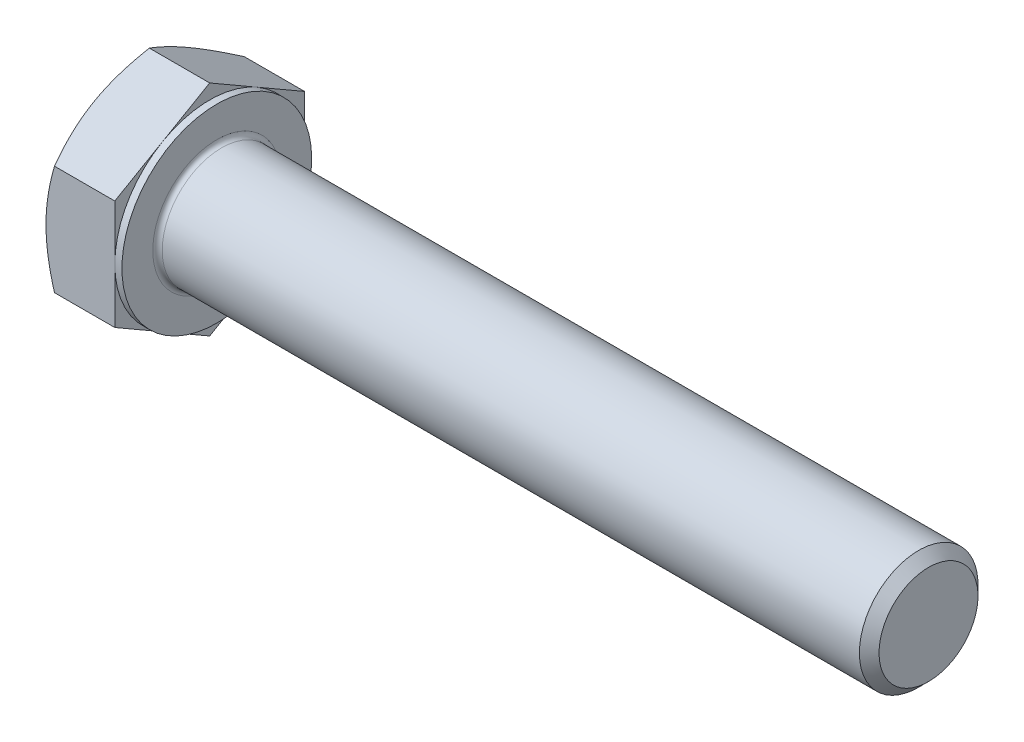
ISO-10303-21;
HEADER;
FILE_DESCRIPTION(('STEP AP214'),'2;1');
FILE_NAME('part.step','',(''),(''),'','','');
FILE_SCHEMA(('AUTOMOTIVE_DESIGN { 1 0 10303 214 1 1 1 1 }'));
ENDSEC;
DATA;
#1=APPLICATION_CONTEXT('core data for automotive mechanical design processes');
#2=APPLICATION_PROTOCOL_DEFINITION('international standard','automotive_design',2000,#1);
#3=PRODUCT_CONTEXT('',#1,'mechanical');
#4=PRODUCT('Part','Part','',(#3));
#5=PRODUCT_RELATED_PRODUCT_CATEGORY('part','',(#4));
#6=PRODUCT_DEFINITION_FORMATION('','',#4);
#7=PRODUCT_DEFINITION_CONTEXT('part definition',#1,'design');
#8=PRODUCT_DEFINITION('design','',#6,#7);
#9=PRODUCT_DEFINITION_SHAPE('','',#8);
#10=(LENGTH_UNIT() NAMED_UNIT(*) SI_UNIT(.MILLI.,.METRE.));
#11=(NAMED_UNIT(*) PLANE_ANGLE_UNIT() SI_UNIT($,.RADIAN.));
#12=(NAMED_UNIT(*) SI_UNIT($,.STERADIAN.) SOLID_ANGLE_UNIT());
#13=UNCERTAINTY_MEASURE_WITH_UNIT(LENGTH_MEASURE(1.E-05),#10,'distance_accuracy_value','');
#14=(GEOMETRIC_REPRESENTATION_CONTEXT(3) GLOBAL_UNCERTAINTY_ASSIGNED_CONTEXT((#13)) GLOBAL_UNIT_ASSIGNED_CONTEXT((#10,
#11,#12)) REPRESENTATION_CONTEXT('',''));
#15=CARTESIAN_POINT('',(0.,0.,0.));
#16=DIRECTION('',(0.,0.,1.));
#17=DIRECTION('',(1.,0.,0.));
#18=AXIS2_PLACEMENT_3D('',#15,#16,#17);
#19=CARTESIAN_POINT('',(6.4,9.23760430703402,0.));
#20=DIRECTION('',(1.,0.,0.));
#21=DIRECTION('',(0.,0.,-1.));
#22=AXIS2_PLACEMENT_3D('',#19,#20,#21);
#23=PLANE('',#22);
#24=CARTESIAN_POINT('',(6.4,0.,0.));
#25=DIRECTION('',(1.,0.,0.));
#26=DIRECTION('',(0.,0.,-1.));
#27=AXIS2_PLACEMENT_3D('',#24,#25,#26);
#28=CIRCLE('',#27,5.4);
#29=CARTESIAN_POINT('',(6.4,0.,-5.4));
#30=VERTEX_POINT('',#29);
#31=EDGE_CURVE('E39',#30,#30,#28,.F.);
#32=ORIENTED_EDGE('',*,*,#31,.T.);
#33=EDGE_LOOP('',(#32));
#34=FACE_BOUND('',#33,.T.);
#35=CARTESIAN_POINT('',(6.4,0.,0.));
#36=DIRECTION('',(1.,0.,0.));
#37=DIRECTION('',(0.,0.,-1.));
#38=AXIS2_PLACEMENT_3D('',#35,#36,#37);
#39=CIRCLE('',#38,8.);
#40=CARTESIAN_POINT('',(6.4,0.,-8.));
#41=VERTEX_POINT('',#40);
#42=EDGE_CURVE('E290',#41,#41,#39,.T.);
#43=ORIENTED_EDGE('',*,*,#42,.T.);
#44=EDGE_LOOP('',(#43));
#45=FACE_BOUND('',#44,.T.);
#46=ADVANCED_FACE('F31',(#34,#45),#23,.T.);
#47=CARTESIAN_POINT('',(0.,0.,0.));
#48=DIRECTION('',(-1.,0.,0.));
#49=DIRECTION('',(0.,0.,1.));
#50=AXIS2_PLACEMENT_3D('',#47,#48,#49);
#51=CYLINDRICAL_SURFACE('',#50,5.);
#52=CARTESIAN_POINT('',(6.8,0.,0.));
#53=DIRECTION('',(1.,0.,0.));
#54=DIRECTION('',(0.,0.,-1.));
#55=AXIS2_PLACEMENT_3D('',#52,#53,#54);
#56=CIRCLE('',#55,5.);
#57=CARTESIAN_POINT('',(6.8,0.,-5.));
#58=VERTEX_POINT('',#57);
#59=EDGE_CURVE('E11',#58,#58,#56,.T.);
#60=ORIENTED_EDGE('',*,*,#59,.T.);
#61=EDGE_LOOP('',(#60));
#62=FACE_BOUND('',#61,.T.);
#63=CARTESIAN_POINT('',(65.572,0.,0.));
#64=DIRECTION('',(-1.,0.,0.));
#65=DIRECTION('',(0.,0.,1.));
#66=AXIS2_PLACEMENT_3D('',#63,#64,#65);
#67=CIRCLE('',#66,5.);
#68=CARTESIAN_POINT('',(65.572,0.,5.));
#69=VERTEX_POINT('',#68);
#70=EDGE_CURVE('E269',#69,#69,#67,.T.);
#71=ORIENTED_EDGE('',*,*,#70,.T.);
#72=EDGE_LOOP('',(#71));
#73=FACE_BOUND('',#72,.T.);
#74=ADVANCED_FACE('F243',(#62,#73),#51,.T.);
#75=CARTESIAN_POINT('',(66.4,0.,0.));
#76=DIRECTION('',(-1.,0.,0.));
#77=DIRECTION('',(0.,0.,1.));
#78=AXIS2_PLACEMENT_3D('',#75,#76,#77);
#79=CONICAL_SURFACE('',#78,4.172,0.785398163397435);
#80=ORIENTED_EDGE('',*,*,#70,.F.);
#81=EDGE_LOOP('',(#80));
#82=FACE_BOUND('',#81,.T.);
#83=CARTESIAN_POINT('',(66.4,0.,0.));
#84=DIRECTION('',(-1.,0.,0.));
#85=DIRECTION('',(0.,0.,1.));
#86=AXIS2_PLACEMENT_3D('',#83,#84,#85);
#87=CIRCLE('',#86,4.172);
#88=CARTESIAN_POINT('',(66.4,0.,4.172));
#89=VERTEX_POINT('',#88);
#90=EDGE_CURVE('E267',#89,#89,#87,.T.);
#91=ORIENTED_EDGE('',*,*,#90,.T.);
#92=EDGE_LOOP('',(#91));
#93=FACE_BOUND('',#92,.T.);
#94=ADVANCED_FACE('F248',(#82,#93),#79,.T.);
#95=CARTESIAN_POINT('',(66.4,0.,0.));
#96=DIRECTION('',(-1.,0.,0.));
#97=DIRECTION('',(0.,0.,1.));
#98=AXIS2_PLACEMENT_3D('',#95,#96,#97);
#99=PLANE('',#98);
#100=ORIENTED_EDGE('',*,*,#90,.F.);
#101=EDGE_LOOP('',(#100));
#102=FACE_BOUND('',#101,.T.);
#103=ADVANCED_FACE('F255',(#102),#99,.F.);
#104=CARTESIAN_POINT('',(5.8,8.,0.));
#105=DIRECTION('',(1.,0.,0.));
#106=DIRECTION('',(0.,0.,-1.));
#107=AXIS2_PLACEMENT_3D('',#104,#105,#106);
#108=PLANE('',#107);
#109=DIRECTION('',(0.,0.500000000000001,0.866025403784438));
#110=VECTOR('',#109,1.);
#111=CARTESIAN_POINT('',(5.8,4.618802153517,-8.));
#112=LINE('',#111,#110);
#113=CARTESIAN_POINT('',(5.8,4.618802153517,-8.));
#114=VERTEX_POINT('',#113);
#115=CARTESIAN_POINT('',(5.8,6.9282032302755,-4.00000000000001));
#116=VERTEX_POINT('',#115);
#117=EDGE_CURVE('E163',#114,#116,#112,.T.);
#118=ORIENTED_EDGE('',*,*,#117,.T.);
#119=CARTESIAN_POINT('',(5.8,0.,0.));
#120=DIRECTION('',(-1.,0.,0.));
#121=DIRECTION('',(0.,0.,1.));
#122=AXIS2_PLACEMENT_3D('',#119,#120,#121);
#123=CIRCLE('',#122,8.);
#124=CARTESIAN_POINT('',(5.8,0.,-8.));
#125=VERTEX_POINT('',#124);
#126=EDGE_CURVE('E46',#116,#125,#123,.T.);
#127=ORIENTED_EDGE('',*,*,#126,.T.);
#128=DIRECTION('',(0.,1.,0.));
#129=VECTOR('',#128,1.);
#130=CARTESIAN_POINT('',(5.8,4.618802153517,-8.));
#131=LINE('',#130,#129);
#132=EDGE_CURVE('E293',#125,#114,#131,.T.);
#133=ORIENTED_EDGE('',*,*,#132,.T.);
#134=EDGE_LOOP('',(#118,#127,#133));
#135=FACE_BOUND('',#134,.T.);
#136=ADVANCED_FACE('F258',(#135),#108,.T.);
#137=CARTESIAN_POINT('',(5.8,9.23760430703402,0.));
#138=VERTEX_POINT('',#137);
#139=EDGE_CURVE('E161',#116,#138,#112,.T.);
#140=ORIENTED_EDGE('',*,*,#139,.T.);
#141=DIRECTION('',(0.,-0.500000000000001,0.866025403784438));
#142=VECTOR('',#141,1.);
#143=CARTESIAN_POINT('',(5.8,9.23760430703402,0.));
#144=LINE('',#143,#142);
#145=CARTESIAN_POINT('',(5.8,6.9282032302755,4.00000000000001));
#146=VERTEX_POINT('',#145);
#147=EDGE_CURVE('E160',#138,#146,#144,.T.);
#148=ORIENTED_EDGE('',*,*,#147,.T.);
#149=EDGE_CURVE('E149',#146,#116,#123,.T.);
#150=ORIENTED_EDGE('',*,*,#149,.T.);
#151=EDGE_LOOP('',(#140,#148,#150));
#152=FACE_BOUND('',#151,.T.);
#153=ADVANCED_FACE('F263',(#152),#108,.T.);
#154=CARTESIAN_POINT('',(5.8,4.618802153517,8.));
#155=VERTEX_POINT('',#154);
#156=EDGE_CURVE('E128',#146,#155,#144,.T.);
#157=ORIENTED_EDGE('',*,*,#156,.T.);
#158=DIRECTION('',(0.,-1.,0.));
#159=VECTOR('',#158,1.);
#160=CARTESIAN_POINT('',(5.8,4.618802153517,8.));
#161=LINE('',#160,#159);
#162=CARTESIAN_POINT('',(5.8,0.,8.));
#163=VERTEX_POINT('',#162);
#164=EDGE_CURVE('E122',#155,#163,#161,.T.);
#165=ORIENTED_EDGE('',*,*,#164,.T.);
#166=EDGE_CURVE('E126',#163,#146,#123,.T.);
#167=ORIENTED_EDGE('',*,*,#166,.T.);
#168=EDGE_LOOP('',(#157,#165,#167));
#169=FACE_BOUND('',#168,.T.);
#170=ADVANCED_FACE('F124',(#169),#108,.T.);
#171=CARTESIAN_POINT('',(5.8,-4.61880215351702,8.));
#172=VERTEX_POINT('',#171);
#173=EDGE_CURVE('E132',#163,#172,#161,.T.);
#174=ORIENTED_EDGE('',*,*,#173,.T.);
#175=DIRECTION('',(0.,-0.500000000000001,-0.866025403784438));
#176=VECTOR('',#175,1.);
#177=CARTESIAN_POINT('',(5.8,-9.23760430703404,0.));
#178=LINE('',#177,#176);
#179=CARTESIAN_POINT('',(5.8,-6.92820323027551,4.00000000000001));
#180=VERTEX_POINT('',#179);
#181=EDGE_CURVE('E139',#172,#180,#178,.T.);
#182=ORIENTED_EDGE('',*,*,#181,.T.);
#183=EDGE_CURVE('E136',#180,#163,#123,.T.);
#184=ORIENTED_EDGE('',*,*,#183,.T.);
#185=EDGE_LOOP('',(#174,#182,#184));
#186=FACE_BOUND('',#185,.T.);
#187=ADVANCED_FACE('F137',(#186),#108,.T.);
#188=CARTESIAN_POINT('',(5.8,-9.23760430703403,0.));
#189=VERTEX_POINT('',#188);
#190=EDGE_CURVE('E155',#180,#189,#178,.T.);
#191=ORIENTED_EDGE('',*,*,#190,.T.);
#192=DIRECTION('',(0.,0.500000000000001,-0.866025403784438));
#193=VECTOR('',#192,1.);
#194=CARTESIAN_POINT('',(5.8,-4.61880215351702,-8.));
#195=LINE('',#194,#193);
#196=CARTESIAN_POINT('',(5.8,-6.92820323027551,-4.00000000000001));
#197=VERTEX_POINT('',#196);
#198=EDGE_CURVE('E331',#189,#197,#195,.T.);
#199=ORIENTED_EDGE('',*,*,#198,.T.);
#200=EDGE_CURVE('E143',#197,#180,#123,.T.);
#201=ORIENTED_EDGE('',*,*,#200,.T.);
#202=EDGE_LOOP('',(#191,#199,#201));
#203=FACE_BOUND('',#202,.T.);
#204=ADVANCED_FACE('F332',(#203),#108,.T.);
#205=CARTESIAN_POINT('',(5.8,-4.61880215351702,-8.));
#206=VERTEX_POINT('',#205);
#207=EDGE_CURVE('E150',#197,#206,#195,.T.);
#208=ORIENTED_EDGE('',*,*,#207,.T.);
#209=EDGE_CURVE('E294',#206,#125,#131,.T.);
#210=ORIENTED_EDGE('',*,*,#209,.T.);
#211=EDGE_CURVE('E301',#125,#197,#123,.T.);
#212=ORIENTED_EDGE('',*,*,#211,.T.);
#213=EDGE_LOOP('',(#208,#210,#212));
#214=FACE_BOUND('',#213,.T.);
#215=ADVANCED_FACE('F264',(#214),#108,.T.);
#216=CARTESIAN_POINT('',(0.,0.,0.));
#217=DIRECTION('',(-1.,0.,0.));
#218=DIRECTION('',(0.,0.,1.));
#219=AXIS2_PLACEMENT_3D('',#216,#217,#218);
#220=CYLINDRICAL_SURFACE('',#219,8.);
#221=ORIENTED_EDGE('',*,*,#126,.F.);
#222=ORIENTED_EDGE('',*,*,#149,.F.);
#223=ORIENTED_EDGE('',*,*,#166,.F.);
#224=ORIENTED_EDGE('',*,*,#183,.F.);
#225=ORIENTED_EDGE('',*,*,#200,.F.);
#226=ORIENTED_EDGE('',*,*,#211,.F.);
#227=EDGE_LOOP('',(#221,#222,#223,#224,#225,#226));
#228=FACE_BOUND('',#227,.T.);
#229=ORIENTED_EDGE('',*,*,#42,.F.);
#230=EDGE_LOOP('',(#229));
#231=FACE_BOUND('',#230,.T.);
#232=ADVANCED_FACE('F146',(#228,#231),#220,.T.);
#233=CARTESIAN_POINT('',(0.,9.23760430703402,0.));
#234=DIRECTION('',(1.,0.,0.));
#235=DIRECTION('',(0.,0.,-1.));
#236=AXIS2_PLACEMENT_3D('',#233,#234,#235);
#237=PLANE('',#236);
#238=CARTESIAN_POINT('',(0.,0.,0.));
#239=DIRECTION('',(1.,0.,0.));
#240=DIRECTION('',(0.,0.,-1.));
#241=AXIS2_PLACEMENT_3D('',#238,#239,#240);
#242=CIRCLE('',#241,8.);
#243=CARTESIAN_POINT('',(0.,0.,-8.));
#244=VERTEX_POINT('',#243);
#245=CARTESIAN_POINT('',(0.,6.92820323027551,-4.00000000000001));
#246=VERTEX_POINT('',#245);
#247=EDGE_CURVE('E289',#244,#246,#242,.T.);
#248=ORIENTED_EDGE('',*,*,#247,.F.);
#249=CARTESIAN_POINT('',(0.,-6.92820323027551,-4.00000000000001));
#250=VERTEX_POINT('',#249);
#251=EDGE_CURVE('E285',#250,#244,#242,.T.);
#252=ORIENTED_EDGE('',*,*,#251,.F.);
#253=CARTESIAN_POINT('',(0.,-6.92820323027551,4.00000000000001));
#254=VERTEX_POINT('',#253);
#255=EDGE_CURVE('E288',#254,#250,#242,.T.);
#256=ORIENTED_EDGE('',*,*,#255,.F.);
#257=CARTESIAN_POINT('',(0.,0.,8.));
#258=VERTEX_POINT('',#257);
#259=EDGE_CURVE('E324',#258,#254,#242,.T.);
#260=ORIENTED_EDGE('',*,*,#259,.F.);
#261=CARTESIAN_POINT('',(0.,0.,0.));
#262=DIRECTION('',(-1.,0.,0.));
#263=DIRECTION('',(0.,0.,1.));
#264=AXIS2_PLACEMENT_3D('',#261,#262,#263);
#265=CIRCLE('',#264,8.);
#266=CARTESIAN_POINT('',(0.,6.92820323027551,4.00000000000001));
#267=VERTEX_POINT('',#266);
#268=EDGE_CURVE('E164',#258,#267,#265,.T.);
#269=ORIENTED_EDGE('',*,*,#268,.T.);
#270=EDGE_CURVE('E347',#246,#267,#242,.T.);
#271=ORIENTED_EDGE('',*,*,#270,.F.);
#272=EDGE_LOOP('',(#248,#252,#256,#260,#269,#271));
#273=FACE_BOUND('',#272,.T.);
#274=ADVANCED_FACE('F193',(#273),#237,.F.);
#275=CARTESIAN_POINT('',(0.,0.,0.));
#276=DIRECTION('',(1.,0.,0.));
#277=DIRECTION('',(0.,0.,-1.));
#278=AXIS2_PLACEMENT_3D('',#275,#276,#277);
#279=CONICAL_SURFACE('',#278,8.,1.0471975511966);
#280=CARTESIAN_POINT('',(0.714597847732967,4.61868668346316,8.0002));
#281=CARTESIAN_POINT('',(0.655990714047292,4.72021302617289,7.8243512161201));
#282=CARTESIAN_POINT('',(0.600043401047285,4.82211789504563,7.64784680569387));
#283=CARTESIAN_POINT('',(0.494201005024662,5.02675523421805,7.29340453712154));
#284=CARTESIAN_POINT('',(0.444308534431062,5.12948804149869,7.11546609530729));
#285=CARTESIAN_POINT('',(0.304692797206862,5.43933133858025,6.57880176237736));
#286=CARTESIAN_POINT('',(0.225281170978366,5.64766491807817,6.21795741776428));
#287=CARTESIAN_POINT('',(0.132161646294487,5.95943209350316,5.67796082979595));
#288=CARTESIAN_POINT('',(0.105634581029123,6.06193429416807,5.50042181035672));
#289=CARTESIAN_POINT('',(0.0611531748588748,6.26740224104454,5.14454088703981));
#290=CARTESIAN_POINT('',(0.043198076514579,6.37036794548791,4.96619905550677));
#291=CARTESIAN_POINT('',(0.0163156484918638,6.57647664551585,4.60920831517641));
#292=CARTESIAN_POINT('',(0.00737807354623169,6.67961930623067,4.4305599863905));
#293=CARTESIAN_POINT('',(-0.00127769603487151,6.88599991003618,4.07309829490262));
#294=CARTESIAN_POINT('',(-0.000996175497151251,6.98923785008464,3.89428493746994));
#295=CARTESIAN_POINT('',(0.00814502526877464,7.18224506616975,3.5599866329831));
#296=CARTESIAN_POINT('',(0.0158896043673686,7.27202796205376,3.40447809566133));
#297=CARTESIAN_POINT('',(0.0382011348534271,7.45138347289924,3.09382523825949));
#298=CARTESIAN_POINT('',(0.0527685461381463,7.5409560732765,2.93868094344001));
#299=CARTESIAN_POINT('',(0.106360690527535,7.80932710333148,2.47384868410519));
#300=CARTESIAN_POINT('',(0.155268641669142,7.98765049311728,2.16498351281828));
#301=CARTESIAN_POINT('',(0.277539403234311,8.34618890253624,1.5439767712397));
#302=CARTESIAN_POINT('',(0.351420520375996,8.52635816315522,1.23191445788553));
#303=CARTESIAN_POINT('',(0.519100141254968,8.88400987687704,0.612443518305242));
#304=CARTESIAN_POINT('',(0.612859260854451,9.06149691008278,0.30502695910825));
#305=CARTESIAN_POINT('',(0.714597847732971,9.23771977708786,-0.000199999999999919));
#306=B_SPLINE_CURVE_WITH_KNOTS('',3,(#280,#281,#282,#283,#284,#285,#286,#287,#288,#289,#290,
#291,#292,#293,#294,#295,#296,#297,#298,#299,#300,#301,#302,#303,#304,#305),.UNSPECIFIED.,.F.,
.F.,(4,2,2,2,2,2,2,2,2,2,2,2,4),(0.,0.633973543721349,1.26821965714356,2.53934712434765,
3.15934343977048,3.77928496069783,4.39852133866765,5.01773858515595,5.55680239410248,
6.09590254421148,7.17487077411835,8.27776850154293,9.37850115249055),.UNSPECIFIED.);
#307=CARTESIAN_POINT('',(0.714531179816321,9.23760430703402,0.));
#308=VERTEX_POINT('',#307);
#309=EDGE_CURVE('E212',#267,#308,#306,.T.);
#310=ORIENTED_EDGE('',*,*,#309,.T.);
#311=CARTESIAN_POINT('',(0.714597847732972,9.23771977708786,0.000199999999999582));
#312=CARTESIAN_POINT('',(0.655990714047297,9.13619343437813,-0.175648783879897));
#313=CARTESIAN_POINT('',(0.60004340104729,9.03428856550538,-0.352153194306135));
#314=CARTESIAN_POINT('',(0.494201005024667,8.82965122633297,-0.706595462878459));
#315=CARTESIAN_POINT('',(0.444308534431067,8.72691841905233,-0.884533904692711));
#316=CARTESIAN_POINT('',(0.304692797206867,8.41707512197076,-1.42119823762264));
#317=CARTESIAN_POINT('',(0.225281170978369,8.20874154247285,-1.78204258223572));
#318=CARTESIAN_POINT('',(0.132161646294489,7.89697436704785,-2.32203917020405));
#319=CARTESIAN_POINT('',(0.105634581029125,7.79447216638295,-2.49957818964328));
#320=CARTESIAN_POINT('',(0.061153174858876,7.58900421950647,-2.8554591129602));
#321=CARTESIAN_POINT('',(0.0431980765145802,7.4860385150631,-3.03380094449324));
#322=CARTESIAN_POINT('',(0.0163156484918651,7.27992981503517,-3.39079168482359));
#323=CARTESIAN_POINT('',(0.00737807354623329,7.17678715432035,-3.5694400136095));
#324=CARTESIAN_POINT('',(-0.00127769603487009,6.97040655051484,-3.92690170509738));
#325=CARTESIAN_POINT('',(-0.000996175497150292,6.86716861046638,-4.10571506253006));
#326=CARTESIAN_POINT('',(0.00814502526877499,6.67416139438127,-4.4400133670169));
#327=CARTESIAN_POINT('',(0.0158896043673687,6.58437849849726,-4.59552190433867));
#328=CARTESIAN_POINT('',(0.0382011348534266,6.40502298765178,-4.90617476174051));
#329=CARTESIAN_POINT('',(0.0527685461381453,6.31545038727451,-5.06131905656));
#330=CARTESIAN_POINT('',(0.106360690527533,6.04707935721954,-5.52615131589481));
#331=CARTESIAN_POINT('',(0.15526864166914,5.86875596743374,-5.83501648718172));
#332=CARTESIAN_POINT('',(0.277539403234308,5.51021755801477,-6.4560232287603));
#333=CARTESIAN_POINT('',(0.351420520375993,5.3300482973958,-6.76808554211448));
#334=CARTESIAN_POINT('',(0.519100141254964,4.97239658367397,-7.38755648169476));
#335=CARTESIAN_POINT('',(0.612859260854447,4.79490955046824,-7.69497304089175));
#336=CARTESIAN_POINT('',(0.714597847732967,4.61868668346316,-8.0002));
#337=B_SPLINE_CURVE_WITH_KNOTS('',3,(#311,#312,#313,#314,#315,#316,#317,#318,#319,#320,#321,
#322,#323,#324,#325,#326,#327,#328,#329,#330,#331,#332,#333,#334,#335,#336),.UNSPECIFIED.,.F.,
.F.,(4,2,2,2,2,2,2,2,2,2,2,2,4),(0.,0.633973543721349,1.26821965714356,2.53934712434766,
3.15934343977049,3.77928496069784,4.39852133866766,5.01773858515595,5.55680239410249,
6.09590254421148,7.17487077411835,8.27776850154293,9.37850115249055),.UNSPECIFIED.);
#338=EDGE_CURVE('E54',#308,#246,#337,.T.);
#339=ORIENTED_EDGE('',*,*,#338,.T.);
#340=ORIENTED_EDGE('',*,*,#270,.T.);
#341=EDGE_LOOP('',(#310,#339,#340));
#342=FACE_BOUND('',#341,.T.);
#343=ADVANCED_FACE('F348',(#342),#279,.T.);
#344=CARTESIAN_POINT('',(4.02490590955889,-12.6546855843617,8.));
#345=CARTESIAN_POINT('',(3.85338487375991,-12.3031246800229,8.));
#346=CARTESIAN_POINT('',(3.683438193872,-11.9507829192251,8.));
#347=CARTESIAN_POINT('',(3.34757427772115,-11.2441233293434,8.));
#348=CARTESIAN_POINT('',(3.1816576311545,-10.889805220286,8.));
#349=CARTESIAN_POINT('',(2.85395194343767,-10.1770689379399,8.));
#350=CARTESIAN_POINT('',(2.69218824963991,-9.81863907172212,8.));
#351=CARTESIAN_POINT('',(2.37495726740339,-9.09901412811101,8.));
#352=CARTESIAN_POINT('',(2.21948969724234,-8.73781917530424,8.));
#353=CARTESIAN_POINT('',(1.91124909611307,-7.99950051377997,8.));
#354=CARTESIAN_POINT('',(1.75875676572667,-7.62225899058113,8.));
#355=CARTESIAN_POINT('',(1.4647241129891,-6.86345576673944,8.));
#356=CARTESIAN_POINT('',(1.32318498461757,-6.4818936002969,8.));
#357=CARTESIAN_POINT('',(1.05459432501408,-5.71447512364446,8.));
#358=CARTESIAN_POINT('',(0.927515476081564,-5.32862847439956,8.));
#359=CARTESIAN_POINT('',(0.691757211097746,-4.55141880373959,8.));
#360=CARTESIAN_POINT('',(0.583072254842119,-4.16005748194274,8.));
#361=CARTESIAN_POINT('',(0.389750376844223,-3.37376378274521,8.));
#362=CARTESIAN_POINT('',(0.304973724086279,-2.9788666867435,8.));
#363=CARTESIAN_POINT('',(0.199275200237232,-2.38273452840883,8.));
#364=CARTESIAN_POINT('',(0.167618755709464,-2.1833797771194,8.));
#365=CARTESIAN_POINT('',(0.112075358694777,-1.78359737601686,8.));
#366=CARTESIAN_POINT('',(0.0881876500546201,-1.58316983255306,8.));
#367=CARTESIAN_POINT('',(0.0489706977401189,-1.18423542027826,8.));
#368=CARTESIAN_POINT('',(0.0335291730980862,-0.985739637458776,8.));
#369=CARTESIAN_POINT('',(0.011062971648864,-0.588272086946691,8.));
#370=CARTESIAN_POINT('',(0.00403814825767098,-0.389300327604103,8.));
#371=CARTESIAN_POINT('',(-0.00142584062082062,0.0087622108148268,8.));
#372=CARTESIAN_POINT('',(0.000134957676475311,0.207852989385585,8.));
#373=CARTESIAN_POINT('',(0.011801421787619,0.605786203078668,8.));
#374=CARTESIAN_POINT('',(0.0219074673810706,0.804628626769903,8.));
#375=CARTESIAN_POINT('',(0.0557165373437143,1.27520491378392,8.));
#376=CARTESIAN_POINT('',(0.0830672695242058,1.54668291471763,8.));
#377=CARTESIAN_POINT('',(0.152259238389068,2.08777092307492,8.));
#378=CARTESIAN_POINT('',(0.194102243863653,2.35738069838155,8.));
#379=CARTESIAN_POINT('',(0.339163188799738,3.16301774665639,8.));
#380=CARTESIAN_POINT('',(0.461891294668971,3.69558688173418,8.));
#381=CARTESIAN_POINT('',(0.676586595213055,4.49226053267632,8.));
#382=CARTESIAN_POINT('',(0.754301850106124,4.76044512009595,8.));
#383=CARTESIAN_POINT('',(0.91827561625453,5.29421544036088,8.));
#384=CARTESIAN_POINT('',(1.00453419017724,5.55980115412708,8.));
#385=CARTESIAN_POINT('',(1.18417203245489,6.08844836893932,8.));
#386=CARTESIAN_POINT('',(1.27754931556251,6.35151055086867,8.));
#387=CARTESIAN_POINT('',(1.47027924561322,6.87542420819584,8.));
#388=CARTESIAN_POINT('',(1.56963178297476,7.13627572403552,8.));
#389=CARTESIAN_POINT('',(1.83061788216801,7.80218874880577,8.));
#390=CARTESIAN_POINT('',(1.99585030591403,8.20583800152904,8.));
#391=CARTESIAN_POINT('',(2.33560643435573,9.00922090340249,8.));
#392=CARTESIAN_POINT('',(2.5101309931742,9.40895418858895,8.));
#393=CARTESIAN_POINT('',(2.86641484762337,10.2053302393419,8.));
#394=CARTESIAN_POINT('',(3.04817649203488,10.6019719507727,8.));
#395=CARTESIAN_POINT('',(3.41731474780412,11.3926098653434,8.));
#396=CARTESIAN_POINT('',(3.60469117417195,11.7866061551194,8.));
#397=CARTESIAN_POINT('',(3.9841797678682,12.5730081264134,8.));
#398=CARTESIAN_POINT('',(4.17629837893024,12.9654106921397,8.));
#399=CARTESIAN_POINT('',(4.56413460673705,13.7484335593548,8.));
#400=CARTESIAN_POINT('',(4.75985224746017,14.1390538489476,8.));
#401=CARTESIAN_POINT('',(5.15417790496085,14.91873869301,8.));
#402=CARTESIAN_POINT('',(5.35278537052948,15.3078035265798,8.));
#403=CARTESIAN_POINT('',(5.75241277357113,16.0846929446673,8.));
#404=CARTESIAN_POINT('',(5.95343272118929,16.4725175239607,8.));
#405=CARTESIAN_POINT('',(6.52023157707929,17.5591699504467,8.));
#406=CARTESIAN_POINT('',(6.88826669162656,18.2568207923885,8.));
#407=CARTESIAN_POINT('',(7.62911645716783,19.6496204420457,8.));
#408=CARTESIAN_POINT('',(8.00193135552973,20.3447691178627,8.));
#409=CARTESIAN_POINT('',(8.74998840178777,21.730949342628,8.));
#410=CARTESIAN_POINT('',(9.12521929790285,22.4219869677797,8.));
#411=CARTESIAN_POINT('',(9.690126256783,23.4573861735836,8.));
#412=CARTESIAN_POINT('',(9.87876537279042,23.8023143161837,8.));
#413=CARTESIAN_POINT('',(10.2566598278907,24.4918321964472,8.));
#414=CARTESIAN_POINT('',(10.4459151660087,24.8364219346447,8.));
#415=CARTESIAN_POINT('',(10.635441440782,25.1808626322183,8.));
#416=B_SPLINE_CURVE_WITH_KNOTS('',3,(#344,#345,#346,#347,#348,#349,#350,#351,#352,#353,#354,
#355,#356,#357,#358,#359,#360,#361,#362,#363,#364,#365,#366,#367,#368,#369,#370,#371,#372,#373,
#374,#375,#376,#377,#378,#379,#380,#381,#382,#383,#384,#385,#386,#387,#388,#389,#390,#391,#392,
#393,#394,#395,#396,#397,#398,#399,#400,#401,#402,#403,#404,#405,#406,#407,#408,#409,#410,#411,
#412,#413,#414,#415),.UNSPECIFIED.,.F.,.F.,(4,2,2,2,2,2,2,2,2,2,2,2,2,2,2,2,2,2,2,2,2,2,2,2,2,2,
2,2,2,2,2,2,2,2,2,4),(0.,1.17352534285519,2.34722138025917,3.52689945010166,4.70652467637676,
5.92708317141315,7.14777452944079,8.36612012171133,9.58409809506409,10.7948027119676,
11.4002329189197,12.0056041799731,12.6027191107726,13.199823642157,13.7969256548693,
14.3940542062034,15.2121538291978,16.0303533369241,17.6675489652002,18.5051258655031,
19.3427089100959,20.1800592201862,21.0173941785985,22.3257038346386,23.6341339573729,
24.9429922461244,26.2518074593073,27.5625113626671,28.8732240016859,30.1836898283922,
31.4941611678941,33.8604585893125,36.2268789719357,38.5858914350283,39.7653150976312,
40.9447368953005),.UNSPECIFIED.);
#417=CARTESIAN_POINT('',(0.714531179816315,4.618802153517,8.));
#418=VERTEX_POINT('',#417);
#419=EDGE_CURVE('E224',#258,#418,#416,.T.);
#420=ORIENTED_EDGE('',*,*,#419,.T.);
#421=EDGE_CURVE('E223',#418,#267,#306,.T.);
#422=ORIENTED_EDGE('',*,*,#421,.T.);
#423=ORIENTED_EDGE('',*,*,#268,.F.);
#424=EDGE_LOOP('',(#420,#422,#423));
#425=FACE_BOUND('',#424,.T.);
#426=ADVANCED_FACE('F318',(#425),#279,.T.);
#427=CARTESIAN_POINT('',(0.714531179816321,-4.61880215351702,8.));
#428=VERTEX_POINT('',#427);
#429=EDGE_CURVE('E270',#428,#258,#416,.T.);
#430=ORIENTED_EDGE('',*,*,#429,.T.);
#431=ORIENTED_EDGE('',*,*,#259,.T.);
#432=CARTESIAN_POINT('',(0.714597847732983,-9.23771977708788,-0.000199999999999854));
#433=CARTESIAN_POINT('',(0.655990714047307,-9.13619343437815,0.175648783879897));
#434=CARTESIAN_POINT('',(0.6000434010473,-9.0342885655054,0.352153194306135));
#435=CARTESIAN_POINT('',(0.494201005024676,-8.82965122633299,0.706595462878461));
#436=CARTESIAN_POINT('',(0.444308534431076,-8.72691841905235,0.884533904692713));
#437=CARTESIAN_POINT('',(0.304692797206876,-8.41707512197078,1.42119823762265));
#438=CARTESIAN_POINT('',(0.225281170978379,-8.20874154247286,1.78204258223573));
#439=CARTESIAN_POINT('',(0.132161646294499,-7.89697436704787,2.32203917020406));
#440=CARTESIAN_POINT('',(0.105634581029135,-7.79447216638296,2.49957818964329));
#441=CARTESIAN_POINT('',(0.0611531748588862,-7.58900421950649,2.8554591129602));
#442=CARTESIAN_POINT('',(0.0431980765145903,-7.48603851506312,3.03380094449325));
#443=CARTESIAN_POINT('',(0.0163156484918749,-7.27992981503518,3.3907916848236));
#444=CARTESIAN_POINT('',(0.00737807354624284,-7.17678715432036,3.56944001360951));
#445=CARTESIAN_POINT('',(-0.00127769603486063,-6.97040655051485,3.92690170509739));
#446=CARTESIAN_POINT('',(-0.000996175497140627,-6.86716861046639,4.10571506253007));
#447=CARTESIAN_POINT('',(0.00814502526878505,-6.67416139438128,4.44001336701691));
#448=CARTESIAN_POINT('',(0.0158896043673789,-6.58437849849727,4.59552190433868));
#449=CARTESIAN_POINT('',(0.0382011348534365,-6.40502298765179,4.90617476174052));
#450=CARTESIAN_POINT('',(0.0527685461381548,-6.31545038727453,5.06131905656));
#451=CARTESIAN_POINT('',(0.106360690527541,-6.04707935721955,5.52615131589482));
#452=CARTESIAN_POINT('',(0.155268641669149,-5.86875596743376,5.83501648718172));
#453=CARTESIAN_POINT('',(0.277539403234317,-5.51021755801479,6.4560232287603));
#454=CARTESIAN_POINT('',(0.351420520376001,-5.33004829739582,6.76808554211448));
#455=CARTESIAN_POINT('',(0.51910014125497,-4.97239658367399,7.38755648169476));
#456=CARTESIAN_POINT('',(0.612859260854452,-4.79490955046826,7.69497304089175));
#457=CARTESIAN_POINT('',(0.714597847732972,-4.61868668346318,8.0002));
#458=B_SPLINE_CURVE_WITH_KNOTS('',3,(#432,#433,#434,#435,#436,#437,#438,#439,#440,#441,#442,
#443,#444,#445,#446,#447,#448,#449,#450,#451,#452,#453,#454,#455,#456,#457),.UNSPECIFIED.,.F.,
.F.,(4,2,2,2,2,2,2,2,2,2,2,2,4),(0.,0.633973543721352,1.26821965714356,2.53934712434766,
3.1593434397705,3.77928496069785,4.39852133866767,5.01773858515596,5.55680239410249,
6.09590254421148,7.17487077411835,8.27776850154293,9.37850115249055),.UNSPECIFIED.);
#459=EDGE_CURVE('E214',#254,#428,#458,.T.);
#460=ORIENTED_EDGE('',*,*,#459,.T.);
#461=EDGE_LOOP('',(#430,#431,#460));
#462=FACE_BOUND('',#461,.T.);
#463=ADVANCED_FACE('F182',(#462),#279,.T.);
#464=CARTESIAN_POINT('',(0.714531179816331,-9.23760430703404,0.));
#465=VERTEX_POINT('',#464);
#466=EDGE_CURVE('E207',#465,#254,#458,.T.);
#467=ORIENTED_EDGE('',*,*,#466,.T.);
#468=ORIENTED_EDGE('',*,*,#255,.T.);
#469=CARTESIAN_POINT('',(0.714597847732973,-4.61868668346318,-8.0002));
#470=CARTESIAN_POINT('',(0.655990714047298,-4.72021302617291,-7.82435121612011));
#471=CARTESIAN_POINT('',(0.600043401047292,-4.82211789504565,-7.64784680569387));
#472=CARTESIAN_POINT('',(0.494201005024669,-5.02675523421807,-7.29340453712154));
#473=CARTESIAN_POINT('',(0.44430853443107,-5.12948804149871,-7.11546609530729));
#474=CARTESIAN_POINT('',(0.304692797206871,-5.43933133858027,-6.57880176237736));
#475=CARTESIAN_POINT('',(0.225281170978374,-5.64766491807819,-6.21795741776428));
#476=CARTESIAN_POINT('',(0.132161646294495,-5.95943209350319,-5.67796082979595));
#477=CARTESIAN_POINT('',(0.105634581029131,-6.06193429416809,-5.50042181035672));
#478=CARTESIAN_POINT('',(0.0611531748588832,-6.26740224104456,-5.1445408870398));
#479=CARTESIAN_POINT('',(0.0431980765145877,-6.37036794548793,-4.96619905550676));
#480=CARTESIAN_POINT('',(0.0163156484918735,-6.57647664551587,-4.60920831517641));
#481=CARTESIAN_POINT('',(0.00737807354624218,-6.67961930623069,-4.4305599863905));
#482=CARTESIAN_POINT('',(-0.00127769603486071,-6.8859999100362,-4.07309829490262));
#483=CARTESIAN_POINT('',(-0.000996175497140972,-6.98923785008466,-3.89428493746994));
#484=CARTESIAN_POINT('',(0.00814502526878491,-7.18224506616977,-3.5599866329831));
#485=CARTESIAN_POINT('',(0.0158896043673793,-7.27202796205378,-3.40447809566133));
#486=CARTESIAN_POINT('',(0.0382011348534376,-7.45138347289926,-3.09382523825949));
#487=CARTESIAN_POINT('',(0.0527685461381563,-7.54095607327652,-2.93868094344));
#488=CARTESIAN_POINT('',(0.106360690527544,-7.8093271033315,-2.47384868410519));
#489=CARTESIAN_POINT('',(0.155268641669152,-7.9876504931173,-2.16498351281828));
#490=CARTESIAN_POINT('',(0.277539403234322,-8.34618890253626,-1.5439767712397));
#491=CARTESIAN_POINT('',(0.351420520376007,-8.52635816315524,-1.23191445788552));
#492=CARTESIAN_POINT('',(0.519100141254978,-8.88400987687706,-0.612443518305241));
#493=CARTESIAN_POINT('',(0.612859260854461,-9.06149691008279,-0.305026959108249));
#494=CARTESIAN_POINT('',(0.714597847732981,-9.23771977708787,0.000200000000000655));
#495=B_SPLINE_CURVE_WITH_KNOTS('',3,(#469,#470,#471,#472,#473,#474,#475,#476,#477,#478,#479,
#480,#481,#482,#483,#484,#485,#486,#487,#488,#489,#490,#491,#492,#493,#494),.UNSPECIFIED.,.F.,
.F.,(4,2,2,2,2,2,2,2,2,2,2,2,4),(0.,0.633973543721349,1.26821965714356,2.53934712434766,
3.15934343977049,3.77928496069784,4.39852133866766,5.01773858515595,5.55680239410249,
6.09590254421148,7.17487077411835,8.27776850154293,9.37850115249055),.UNSPECIFIED.);
#496=EDGE_CURVE('E213',#250,#465,#495,.T.);
#497=ORIENTED_EDGE('',*,*,#496,.T.);
#498=EDGE_LOOP('',(#467,#468,#497));
#499=FACE_BOUND('',#498,.T.);
#500=ADVANCED_FACE('F346',(#499),#279,.T.);
#501=CARTESIAN_POINT('',(0.714531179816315,4.618802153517,-8.));
#502=VERTEX_POINT('',#501);
#503=EDGE_CURVE('E215',#246,#502,#337,.T.);
#504=ORIENTED_EDGE('',*,*,#503,.T.);
#505=CARTESIAN_POINT('',(4.02490591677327,-12.6546855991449,-8.));
#506=CARTESIAN_POINT('',(3.8533848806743,-12.3031246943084,-8.));
#507=CARTESIAN_POINT('',(3.68343820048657,-11.9507829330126,-8.));
#508=CARTESIAN_POINT('',(3.34757428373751,-11.2441233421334,-8.));
#509=CARTESIAN_POINT('',(3.18165763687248,-10.8898052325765,-8.));
#510=CARTESIAN_POINT('',(2.85395194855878,-10.177068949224,-8.));
#511=CARTESIAN_POINT('',(2.69218825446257,-9.81863908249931,-8.));
#512=CARTESIAN_POINT('',(2.37495727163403,-9.09901413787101,-8.));
#513=CARTESIAN_POINT('',(2.21948970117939,-8.73781918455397,-8.));
#514=CARTESIAN_POINT('',(1.91124909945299,-7.99950052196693,-8.));
#515=CARTESIAN_POINT('',(1.75875676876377,-7.62225899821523,-8.));
#516=CARTESIAN_POINT('',(1.46472411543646,-6.86345577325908,-8.));
#517=CARTESIAN_POINT('',(1.32318498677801,-6.48189360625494,-8.));
#518=CARTESIAN_POINT('',(1.0545943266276,-5.71447512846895,-8.));
#519=CARTESIAN_POINT('',(0.92751547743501,-5.32862847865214,-8.));
#520=CARTESIAN_POINT('',(0.691757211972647,-4.55141880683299,-8.));
#521=CARTESIAN_POINT('',(0.583072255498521,-4.1600574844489,-8.));
#522=CARTESIAN_POINT('',(0.389750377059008,-3.37376378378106,-8.));
#523=CARTESIAN_POINT('',(0.30497372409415,-2.97886668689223,-8.));
#524=CARTESIAN_POINT('',(0.19927520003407,-2.38273452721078,-8.));
#525=CARTESIAN_POINT('',(0.167618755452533,-2.1833797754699,-8.));
#526=CARTESIAN_POINT('',(0.112075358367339,-1.78359737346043,-8.));
#527=CARTESIAN_POINT('',(0.0881876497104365,-1.58316982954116,-8.));
#528=CARTESIAN_POINT('',(0.0489706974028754,-1.18423541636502,-8.));
#529=CARTESIAN_POINT('',(0.0335291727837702,-0.985739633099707,-8.));
#530=CARTESIAN_POINT('',(0.0110629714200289,-0.588272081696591,-8.));
#531=CARTESIAN_POINT('',(0.00403814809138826,-0.3893003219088,-8.));
#532=CARTESIAN_POINT('',(-0.00142584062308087,0.00876221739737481,-8.));
#533=CARTESIAN_POINT('',(0.000134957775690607,0.207852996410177,-8.));
#534=CARTESIAN_POINT('',(0.011801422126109,0.605786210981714,-8.));
#535=CARTESIAN_POINT('',(0.0219074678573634,0.80462863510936,-8.));
#536=CARTESIAN_POINT('',(0.0557165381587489,1.27520492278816,-8.));
#537=CARTESIAN_POINT('',(0.0830672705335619,1.54668292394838,-8.));
#538=CARTESIAN_POINT('',(0.152259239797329,2.08777093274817,-8.));
#539=CARTESIAN_POINT('',(0.194102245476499,2.35738070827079,-8.));
#540=CARTESIAN_POINT('',(0.339163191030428,3.16301775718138,-8.));
#541=CARTESIAN_POINT('',(0.461891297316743,3.69558689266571,-8.));
#542=CARTESIAN_POINT('',(0.676586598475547,4.4922605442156,-8.));
#543=CARTESIAN_POINT('',(0.75430185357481,4.7604451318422,-8.));
#544=CARTESIAN_POINT('',(0.918275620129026,5.29421545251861,-8.));
#545=CARTESIAN_POINT('',(1.00453419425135,5.55980116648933,-8.));
#546=CARTESIAN_POINT('',(1.1841720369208,6.08844838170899,-8.));
#547=CARTESIAN_POINT('',(1.27754932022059,6.35151056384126,-8.));
#548=CARTESIAN_POINT('',(1.47027925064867,6.87542422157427,-8.));
#549=CARTESIAN_POINT('',(1.56963178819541,7.13627573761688,-8.));
#550=CARTESIAN_POINT('',(1.83061788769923,7.80218876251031,-8.));
#551=CARTESIAN_POINT('',(1.99585031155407,8.2058380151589,-8.));
#552=CARTESIAN_POINT('',(2.33560644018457,9.00922091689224,-8.));
#553=CARTESIAN_POINT('',(2.51013099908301,9.40895420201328,-8.));
#554=CARTESIAN_POINT('',(2.86641485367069,10.2053302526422,-8.));
#555=CARTESIAN_POINT('',(3.04817649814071,10.6019719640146,-8.));
#556=CARTESIAN_POINT('',(3.41731475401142,11.3926098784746,-8.));
#557=CARTESIAN_POINT('',(3.60469118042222,11.7866061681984,-8.));
#558=CARTESIAN_POINT('',(3.98417977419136,12.5730081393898,-8.));
#559=CARTESIAN_POINT('',(4.17629838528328,12.9654107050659,-8.));
#560=CARTESIAN_POINT('',(4.56413461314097,13.7484335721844,-8.));
#561=CARTESIAN_POINT('',(4.75985225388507,14.1390538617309,-8.));
#562=CARTESIAN_POINT('',(5.15417791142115,14.9187387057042,-8.));
#563=CARTESIAN_POINT('',(5.3527853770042,15.3078035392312,-8.));
#564=CARTESIAN_POINT('',(5.75241278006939,16.0846929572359,-8.));
#565=CARTESIAN_POINT('',(5.95343272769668,16.4725175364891,-8.));
#566=CARTESIAN_POINT('',(6.52023158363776,17.559169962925,-8.));
#567=CARTESIAN_POINT('',(6.88826669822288,18.2568208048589,-8.));
#568=CARTESIAN_POINT('',(7.62911646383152,19.6496204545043,-8.));
#569=CARTESIAN_POINT('',(8.00193136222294,20.3447691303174,-8.));
#570=CARTESIAN_POINT('',(8.74998840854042,21.7309493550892,-8.));
#571=CARTESIAN_POINT('',(9.12521930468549,22.4219869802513,-8.));
#572=CARTESIAN_POINT('',(9.69012626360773,23.4573861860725,-8.));
#573=CARTESIAN_POINT('',(9.87876537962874,23.8023143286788,-8.));
#574=CARTESIAN_POINT('',(10.2566598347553,24.491832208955,-8.));
#575=CARTESIAN_POINT('',(10.4459151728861,24.8364219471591,-8.));
#576=CARTESIAN_POINT('',(10.6354414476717,25.1808626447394,-8.));
#577=B_SPLINE_CURVE_WITH_KNOTS('',3,(#505,#506,#507,#508,#509,#510,#511,#512,#513,#514,#515,
#516,#517,#518,#519,#520,#521,#522,#523,#524,#525,#526,#527,#528,#529,#530,#531,#532,#533,#534,
#535,#536,#537,#538,#539,#540,#541,#542,#543,#544,#545,#546,#547,#548,#549,#550,#551,#552,#553,
#554,#555,#556,#557,#558,#559,#560,#561,#562,#563,#564,#565,#566,#567,#568,#569,#570,#571,#572,
#573,#574,#575,#576),.UNSPECIFIED.,.F.,.F.,(4,2,2,2,2,2,2,2,2,2,2,2,2,2,2,2,2,2,2,2,2,2,2,2,2,2,
2,2,2,2,2,2,2,2,2,4),(0.,1.17352534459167,2.34722138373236,3.52689945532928,4.70652468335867,
5.92708318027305,7.14777454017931,8.36612013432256,9.58409810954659,10.7948027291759,
11.40023293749,12.0056041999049,12.6027191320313,13.1998236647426,13.7969256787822,
14.3940542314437,15.2121538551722,16.0303533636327,17.6675489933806,18.5051258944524,
19.3427089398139,20.180059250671,21.0173942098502,22.3257038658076,23.6341339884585,
24.9429922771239,26.2518074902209,27.5625113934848,28.8732240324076,30.1836898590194,
31.494161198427,33.8604586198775,36.2268790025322,38.5858914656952,39.7653151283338,
40.9447369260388),.UNSPECIFIED.);
#578=EDGE_CURVE('E175',#502,#244,#577,.F.);
#579=ORIENTED_EDGE('',*,*,#578,.T.);
#580=ORIENTED_EDGE('',*,*,#247,.T.);
#581=EDGE_LOOP('',(#504,#579,#580));
#582=FACE_BOUND('',#581,.T.);
#583=ADVANCED_FACE('F343',(#582),#279,.T.);
#584=CARTESIAN_POINT('',(0.714531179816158,-4.61880215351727,-8.));
#585=VERTEX_POINT('',#584);
#586=EDGE_CURVE('E176',#585,#250,#495,.T.);
#587=ORIENTED_EDGE('',*,*,#586,.T.);
#588=ORIENTED_EDGE('',*,*,#251,.T.);
#589=EDGE_CURVE('E167',#244,#585,#577,.F.);
#590=ORIENTED_EDGE('',*,*,#589,.T.);
#591=EDGE_LOOP('',(#587,#588,#590));
#592=FACE_BOUND('',#591,.T.);
#593=ADVANCED_FACE('F191',(#592),#279,.T.);
#594=CARTESIAN_POINT('',(6.4,4.618802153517,-8.));
#595=DIRECTION('',(0.,0.,1.));
#596=DIRECTION('',(0.,-1.,0.));
#597=AXIS2_PLACEMENT_3D('',#594,#595,#596);
#598=PLANE('',#597);
#599=ORIENTED_EDGE('',*,*,#209,.F.);
#600=DIRECTION('',(-1.,0.,0.));
#601=VECTOR('',#600,1.);
#602=CARTESIAN_POINT('',(6.4,-4.61880215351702,-8.));
#603=LINE('',#602,#601);
#604=EDGE_CURVE('E276',#206,#585,#603,.T.);
#605=ORIENTED_EDGE('',*,*,#604,.T.);
#606=ORIENTED_EDGE('',*,*,#589,.F.);
#607=ORIENTED_EDGE('',*,*,#578,.F.);
#608=DIRECTION('',(-1.,0.,0.));
#609=VECTOR('',#608,1.);
#610=CARTESIAN_POINT('',(6.4,4.618802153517,-8.));
#611=LINE('',#610,#609);
#612=EDGE_CURVE('E272',#114,#502,#611,.T.);
#613=ORIENTED_EDGE('',*,*,#612,.F.);
#614=ORIENTED_EDGE('',*,*,#132,.F.);
#615=EDGE_LOOP('',(#599,#605,#606,#607,#613,#614));
#616=FACE_BOUND('',#615,.T.);
#617=ADVANCED_FACE('F186',(#616),#598,.F.);
#618=CARTESIAN_POINT('',(6.4,-4.61880215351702,-8.));
#619=DIRECTION('',(0.,0.866025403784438,0.500000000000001));
#620=DIRECTION('',(0.,-0.500000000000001,0.866025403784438));
#621=AXIS2_PLACEMENT_3D('',#618,#619,#620);
#622=PLANE('',#621);
#623=ORIENTED_EDGE('',*,*,#198,.F.);
#624=DIRECTION('',(-1.,0.,0.));
#625=VECTOR('',#624,1.);
#626=CARTESIAN_POINT('',(6.4,-9.23760430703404,0.));
#627=LINE('',#626,#625);
#628=EDGE_CURVE('E278',#189,#465,#627,.T.);
#629=ORIENTED_EDGE('',*,*,#628,.T.);
#630=ORIENTED_EDGE('',*,*,#496,.F.);
#631=ORIENTED_EDGE('',*,*,#586,.F.);
#632=ORIENTED_EDGE('',*,*,#604,.F.);
#633=ORIENTED_EDGE('',*,*,#207,.F.);
#634=EDGE_LOOP('',(#623,#629,#630,#631,#632,#633));
#635=FACE_BOUND('',#634,.T.);
#636=ADVANCED_FACE('F190',(#635),#622,.F.);
#637=CARTESIAN_POINT('',(6.4,-9.23760430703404,0.));
#638=DIRECTION('',(0.,0.866025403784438,-0.500000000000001));
#639=DIRECTION('',(0.,0.500000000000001,0.866025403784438));
#640=AXIS2_PLACEMENT_3D('',#637,#638,#639);
#641=PLANE('',#640);
#642=ORIENTED_EDGE('',*,*,#181,.F.);
#643=DIRECTION('',(-1.,0.,0.));
#644=VECTOR('',#643,1.);
#645=CARTESIAN_POINT('',(6.4,-4.61880215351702,8.));
#646=LINE('',#645,#644);
#647=EDGE_CURVE('E154',#172,#428,#646,.T.);
#648=ORIENTED_EDGE('',*,*,#647,.T.);
#649=ORIENTED_EDGE('',*,*,#459,.F.);
#650=ORIENTED_EDGE('',*,*,#466,.F.);
#651=ORIENTED_EDGE('',*,*,#628,.F.);
#652=ORIENTED_EDGE('',*,*,#190,.F.);
#653=EDGE_LOOP('',(#642,#648,#649,#650,#651,#652));
#654=FACE_BOUND('',#653,.T.);
#655=ADVANCED_FACE('F198',(#654),#641,.F.);
#656=CARTESIAN_POINT('',(6.4,4.618802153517,8.));
#657=DIRECTION('',(0.,0.,-1.));
#658=DIRECTION('',(-1.,0.,0.));
#659=AXIS2_PLACEMENT_3D('',#656,#657,#658);
#660=PLANE('',#659);
#661=ORIENTED_EDGE('',*,*,#164,.F.);
#662=DIRECTION('',(-1.,0.,0.));
#663=VECTOR('',#662,1.);
#664=CARTESIAN_POINT('',(6.4,4.618802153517,8.));
#665=LINE('',#664,#663);
#666=EDGE_CURVE('E281',#155,#418,#665,.T.);
#667=ORIENTED_EDGE('',*,*,#666,.T.);
#668=ORIENTED_EDGE('',*,*,#419,.F.);
#669=ORIENTED_EDGE('',*,*,#429,.F.);
#670=ORIENTED_EDGE('',*,*,#647,.F.);
#671=ORIENTED_EDGE('',*,*,#173,.F.);
#672=EDGE_LOOP('',(#661,#667,#668,#669,#670,#671));
#673=FACE_BOUND('',#672,.T.);
#674=ADVANCED_FACE('F152',(#673),#660,.F.);
#675=CARTESIAN_POINT('',(6.4,9.23760430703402,0.));
#676=DIRECTION('',(0.,-0.866025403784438,-0.500000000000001));
#677=DIRECTION('',(0.,0.500000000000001,-0.866025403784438));
#678=AXIS2_PLACEMENT_3D('',#675,#676,#677);
#679=PLANE('',#678);
#680=ORIENTED_EDGE('',*,*,#147,.F.);
#681=DIRECTION('',(-1.,0.,0.));
#682=VECTOR('',#681,1.);
#683=CARTESIAN_POINT('',(6.4,9.23760430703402,0.));
#684=LINE('',#683,#682);
#685=EDGE_CURVE('E283',#138,#308,#684,.T.);
#686=ORIENTED_EDGE('',*,*,#685,.T.);
#687=ORIENTED_EDGE('',*,*,#309,.F.);
#688=ORIENTED_EDGE('',*,*,#421,.F.);
#689=ORIENTED_EDGE('',*,*,#666,.F.);
#690=ORIENTED_EDGE('',*,*,#156,.F.);
#691=EDGE_LOOP('',(#680,#686,#687,#688,#689,#690));
#692=FACE_BOUND('',#691,.T.);
#693=ADVANCED_FACE('F229',(#692),#679,.F.);
#694=CARTESIAN_POINT('',(6.4,4.618802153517,-8.));
#695=DIRECTION('',(0.,-0.866025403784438,0.500000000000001));
#696=DIRECTION('',(0.,-0.500000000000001,-0.866025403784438));
#697=AXIS2_PLACEMENT_3D('',#694,#695,#696);
#698=PLANE('',#697);
#699=ORIENTED_EDGE('',*,*,#117,.F.);
#700=ORIENTED_EDGE('',*,*,#612,.T.);
#701=ORIENTED_EDGE('',*,*,#503,.F.);
#702=ORIENTED_EDGE('',*,*,#338,.F.);
#703=ORIENTED_EDGE('',*,*,#685,.F.);
#704=ORIENTED_EDGE('',*,*,#139,.F.);
#705=EDGE_LOOP('',(#699,#700,#701,#702,#703,#704));
#706=FACE_BOUND('',#705,.T.);
#707=ADVANCED_FACE('F232',(#706),#698,.F.);
#708=CARTESIAN_POINT('',(6.8,0.,0.));
#709=DIRECTION('',(1.,0.,0.));
#710=DIRECTION('',(0.,0.,-1.));
#711=AXIS2_PLACEMENT_3D('',#708,#709,#710);
#712=TOROIDAL_SURFACE('',#711,5.4,0.4);
#713=ORIENTED_EDGE('',*,*,#59,.F.);
#714=EDGE_LOOP('',(#713));
#715=FACE_BOUND('',#714,.T.);
#716=ORIENTED_EDGE('',*,*,#31,.F.);
#717=EDGE_LOOP('',(#716));
#718=FACE_BOUND('',#717,.T.);
#719=ADVANCED_FACE('F33',(#715,#718),#712,.F.);
#720=CLOSED_SHELL('',(#46,#74,#94,#103,#136,#153,#170,#187,#204,#215,#232,#274,#343,#426,#463,
#500,#583,#593,#617,#636,#655,#674,#693,#707,#719));
#721=MANIFOLD_SOLID_BREP('B2',#720);
#722=ADVANCED_BREP_SHAPE_REPRESENTATION('',(#18,#721),#14);
#723=SHAPE_DEFINITION_REPRESENTATION(#9,#722);
ENDSEC;
END-ISO-10303-21;
